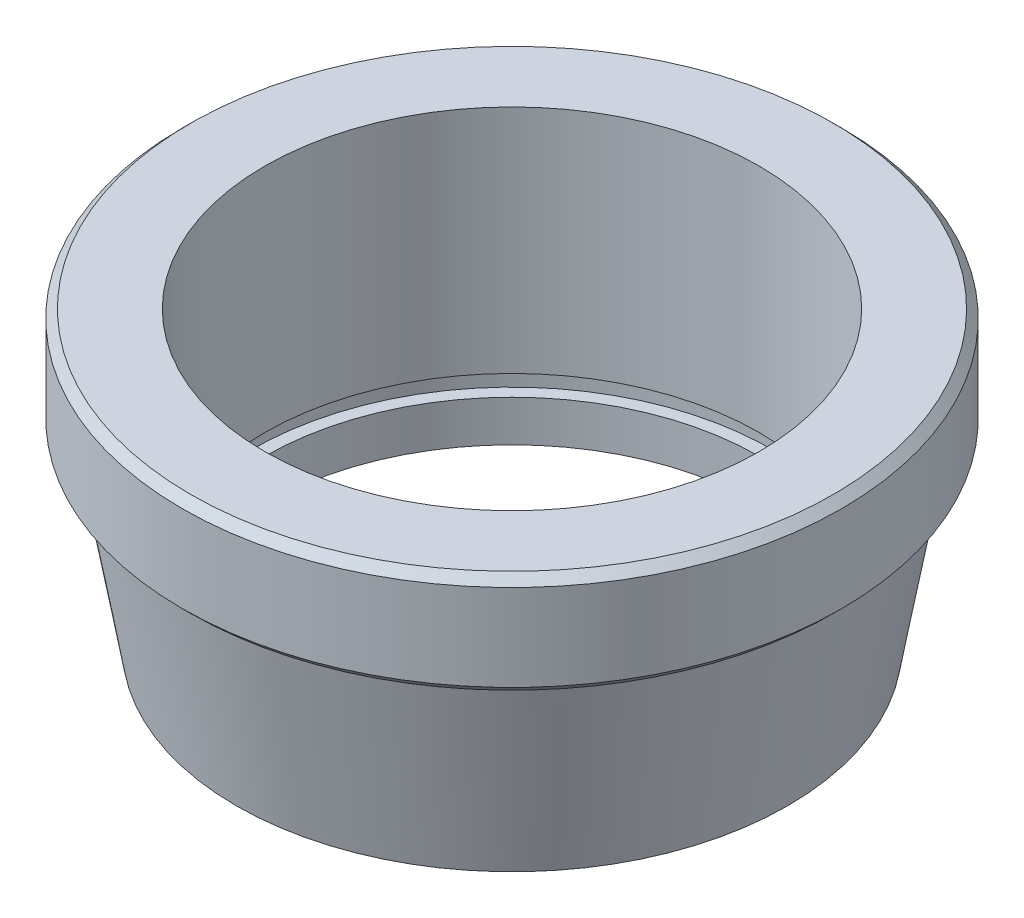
ISO-10303-21;
HEADER;
FILE_DESCRIPTION(('STEP AP214'),'2;1');
FILE_NAME('part.step','',(''),(''),'','','');
FILE_SCHEMA(('AUTOMOTIVE_DESIGN { 1 0 10303 214 1 1 1 1 }'));
ENDSEC;
DATA;
#1=APPLICATION_CONTEXT('core data for automotive mechanical design processes');
#2=APPLICATION_PROTOCOL_DEFINITION('international standard','automotive_design',2000,#1);
#3=PRODUCT_CONTEXT('',#1,'mechanical');
#4=PRODUCT('Part','Part','',(#3));
#5=PRODUCT_RELATED_PRODUCT_CATEGORY('part','',(#4));
#6=PRODUCT_DEFINITION_FORMATION('','',#4);
#7=PRODUCT_DEFINITION_CONTEXT('part definition',#1,'design');
#8=PRODUCT_DEFINITION('design','',#6,#7);
#9=PRODUCT_DEFINITION_SHAPE('','',#8);
#10=(LENGTH_UNIT() NAMED_UNIT(*) SI_UNIT(.MILLI.,.METRE.));
#11=(NAMED_UNIT(*) PLANE_ANGLE_UNIT() SI_UNIT($,.RADIAN.));
#12=(NAMED_UNIT(*) SI_UNIT($,.STERADIAN.) SOLID_ANGLE_UNIT());
#13=UNCERTAINTY_MEASURE_WITH_UNIT(LENGTH_MEASURE(1.E-05),#10,'distance_accuracy_value','');
#14=(GEOMETRIC_REPRESENTATION_CONTEXT(3) GLOBAL_UNCERTAINTY_ASSIGNED_CONTEXT((#13)) GLOBAL_UNIT_ASSIGNED_CONTEXT((#10,
#11,#12)) REPRESENTATION_CONTEXT('',''));
#15=CARTESIAN_POINT('',(0.,0.,0.));
#16=DIRECTION('',(0.,0.,1.));
#17=DIRECTION('',(1.,0.,0.));
#18=AXIS2_PLACEMENT_3D('',#15,#16,#17);
#19=CARTESIAN_POINT('',(0.,0.,0.));
#20=DIRECTION('',(0.,1.,0.));
#21=DIRECTION('',(0.,0.,1.));
#22=AXIS2_PLACEMENT_3D('',#19,#20,#21);
#23=CYLINDRICAL_SURFACE('',#22,6.);
#24=CARTESIAN_POINT('',(0.,-3.1,0.));
#25=DIRECTION('',(0.,1.,0.));
#26=DIRECTION('',(0.,0.,1.));
#27=AXIS2_PLACEMENT_3D('',#24,#25,#26);
#28=CIRCLE('',#27,6.);
#29=CARTESIAN_POINT('',(0.,-3.1,6.));
#30=VERTEX_POINT('',#29);
#31=EDGE_CURVE('E66',#30,#30,#28,.T.);
#32=ORIENTED_EDGE('',*,*,#31,.F.);
#33=EDGE_LOOP('',(#32));
#34=FACE_BOUND('',#33,.T.);
#35=CARTESIAN_POINT('',(0.,2.5,0.));
#36=DIRECTION('',(0.,1.,0.));
#37=DIRECTION('',(0.,0.,1.));
#38=AXIS2_PLACEMENT_3D('',#35,#36,#37);
#39=CIRCLE('',#38,6.);
#40=CARTESIAN_POINT('',(0.,2.5,6.));
#41=VERTEX_POINT('',#40);
#42=EDGE_CURVE('E57',#41,#41,#39,.T.);
#43=ORIENTED_EDGE('',*,*,#42,.T.);
#44=EDGE_LOOP('',(#43));
#45=FACE_BOUND('',#44,.T.);
#46=ADVANCED_FACE('F31',(#34,#45),#23,.F.);
#47=CARTESIAN_POINT('',(0.,0.,0.));
#48=DIRECTION('',(0.,1.,0.));
#49=DIRECTION('',(0.,0.,1.));
#50=AXIS2_PLACEMENT_3D('',#47,#48,#49);
#51=CONICAL_SURFACE('',#50,7.5,0.174532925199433);
#52=CARTESIAN_POINT('',(0.,-4.6,0.));
#53=DIRECTION('',(0.,1.,0.));
#54=DIRECTION('',(0.,0.,1.));
#55=AXIS2_PLACEMENT_3D('',#52,#53,#54);
#56=CIRCLE('',#55,6.68889588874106);
#57=CARTESIAN_POINT('',(0.,-4.6,6.68889588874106));
#58=VERTEX_POINT('',#57);
#59=EDGE_CURVE('E51',#58,#58,#56,.T.);
#60=ORIENTED_EDGE('',*,*,#59,.T.);
#61=EDGE_LOOP('',(#60));
#62=FACE_BOUND('',#61,.T.);
#63=CARTESIAN_POINT('',(0.,0.,0.));
#64=DIRECTION('',(0.,1.,0.));
#65=DIRECTION('',(0.,0.,1.));
#66=AXIS2_PLACEMENT_3D('',#63,#64,#65);
#67=CIRCLE('',#66,7.5);
#68=CARTESIAN_POINT('',(0.,0.,7.5));
#69=VERTEX_POINT('',#68);
#70=EDGE_CURVE('E54',#69,#69,#67,.T.);
#71=ORIENTED_EDGE('',*,*,#70,.F.);
#72=EDGE_LOOP('',(#71));
#73=FACE_BOUND('',#72,.T.);
#74=ADVANCED_FACE('F93',(#62,#73),#51,.T.);
#75=CARTESIAN_POINT('',(0.,-4.6,0.));
#76=DIRECTION('',(0.,1.,0.));
#77=DIRECTION('',(0.,0.,1.));
#78=AXIS2_PLACEMENT_3D('',#75,#76,#77);
#79=PLANE('',#78);
#80=CARTESIAN_POINT('',(0.,-4.6,0.));
#81=DIRECTION('',(0.,-1.,0.));
#82=DIRECTION('',(0.,0.,-1.));
#83=AXIS2_PLACEMENT_3D('',#80,#81,#82);
#84=CIRCLE('',#83,6.);
#85=CARTESIAN_POINT('',(0.,-4.6,-6.));
#86=VERTEX_POINT('',#85);
#87=EDGE_CURVE('E60',#86,#86,#84,.T.);
#88=ORIENTED_EDGE('',*,*,#87,.F.);
#89=EDGE_LOOP('',(#88));
#90=FACE_BOUND('',#89,.T.);
#91=ORIENTED_EDGE('',*,*,#59,.F.);
#92=EDGE_LOOP('',(#91));
#93=FACE_BOUND('',#92,.T.);
#94=ADVANCED_FACE('F108',(#90,#93),#79,.F.);
#95=CARTESIAN_POINT('',(0.,2.5,0.));
#96=DIRECTION('',(0.,-1.,0.));
#97=DIRECTION('',(0.,0.,-1.));
#98=AXIS2_PLACEMENT_3D('',#95,#96,#97);
#99=CYLINDRICAL_SURFACE('',#98,8.);
#100=CARTESIAN_POINT('',(0.,0.199999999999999,0.));
#101=DIRECTION('',(0.,1.,0.));
#102=DIRECTION('',(0.,0.,1.));
#103=AXIS2_PLACEMENT_3D('',#100,#101,#102);
#104=CIRCLE('',#103,8.);
#105=CARTESIAN_POINT('',(0.,0.199999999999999,8.));
#106=VERTEX_POINT('',#105);
#107=EDGE_CURVE('E42',#106,#106,#104,.T.);
#108=ORIENTED_EDGE('',*,*,#107,.T.);
#109=EDGE_LOOP('',(#108));
#110=FACE_BOUND('',#109,.T.);
#111=CARTESIAN_POINT('',(0.,2.3,0.));
#112=DIRECTION('',(0.,1.,0.));
#113=DIRECTION('',(0.,0.,1.));
#114=AXIS2_PLACEMENT_3D('',#111,#112,#113);
#115=CIRCLE('',#114,8.);
#116=CARTESIAN_POINT('',(0.,2.3,8.));
#117=VERTEX_POINT('',#116);
#118=EDGE_CURVE('E46',#117,#117,#115,.F.);
#119=ORIENTED_EDGE('',*,*,#118,.T.);
#120=EDGE_LOOP('',(#119));
#121=FACE_BOUND('',#120,.T.);
#122=ADVANCED_FACE('F100',(#110,#121),#99,.T.);
#123=CARTESIAN_POINT('',(0.,2.5,0.));
#124=DIRECTION('',(0.,1.,0.));
#125=DIRECTION('',(0.,0.,1.));
#126=AXIS2_PLACEMENT_3D('',#123,#124,#125);
#127=PLANE('',#126);
#128=ORIENTED_EDGE('',*,*,#42,.F.);
#129=EDGE_LOOP('',(#128));
#130=FACE_BOUND('',#129,.T.);
#131=CARTESIAN_POINT('',(0.,2.5,0.));
#132=DIRECTION('',(0.,1.,0.));
#133=DIRECTION('',(0.,0.,1.));
#134=AXIS2_PLACEMENT_3D('',#131,#132,#133);
#135=CIRCLE('',#134,7.8);
#136=CARTESIAN_POINT('',(0.,2.5,7.8));
#137=VERTEX_POINT('',#136);
#138=EDGE_CURVE('E10',#137,#137,#135,.T.);
#139=ORIENTED_EDGE('',*,*,#138,.T.);
#140=EDGE_LOOP('',(#139));
#141=FACE_BOUND('',#140,.T.);
#142=ADVANCED_FACE('F97',(#130,#141),#127,.T.);
#143=CARTESIAN_POINT('',(0.,0.,0.));
#144=DIRECTION('',(0.,1.,0.));
#145=DIRECTION('',(0.,0.,1.));
#146=AXIS2_PLACEMENT_3D('',#143,#144,#145);
#147=PLANE('',#146);
#148=CARTESIAN_POINT('',(0.,0.,0.));
#149=DIRECTION('',(0.,1.,0.));
#150=DIRECTION('',(0.,0.,1.));
#151=AXIS2_PLACEMENT_3D('',#148,#149,#150);
#152=CIRCLE('',#151,7.8);
#153=CARTESIAN_POINT('',(0.,0.,7.8));
#154=VERTEX_POINT('',#153);
#155=EDGE_CURVE('E38',#154,#154,#152,.F.);
#156=ORIENTED_EDGE('',*,*,#155,.T.);
#157=EDGE_LOOP('',(#156));
#158=FACE_BOUND('',#157,.T.);
#159=ORIENTED_EDGE('',*,*,#70,.T.);
#160=EDGE_LOOP('',(#159));
#161=FACE_BOUND('',#160,.T.);
#162=ADVANCED_FACE('F99',(#158,#161),#147,.F.);
#163=CARTESIAN_POINT('',(0.,0.199999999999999,0.));
#164=DIRECTION('',(0.,1.,0.));
#165=DIRECTION('',(0.,0.,1.));
#166=AXIS2_PLACEMENT_3D('',#163,#164,#165);
#167=CONICAL_SURFACE('',#166,8.,0.785398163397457);
#168=ORIENTED_EDGE('',*,*,#155,.F.);
#169=EDGE_LOOP('',(#168));
#170=FACE_BOUND('',#169,.T.);
#171=ORIENTED_EDGE('',*,*,#107,.F.);
#172=EDGE_LOOP('',(#171));
#173=FACE_BOUND('',#172,.T.);
#174=ADVANCED_FACE('F106',(#170,#173),#167,.T.);
#175=CARTESIAN_POINT('',(0.,2.5,0.));
#176=DIRECTION('',(0.,-1.,0.));
#177=DIRECTION('',(0.,0.,-1.));
#178=AXIS2_PLACEMENT_3D('',#175,#176,#177);
#179=CONICAL_SURFACE('',#178,7.8,0.785398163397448);
#180=ORIENTED_EDGE('',*,*,#118,.F.);
#181=EDGE_LOOP('',(#180));
#182=FACE_BOUND('',#181,.T.);
#183=ORIENTED_EDGE('',*,*,#138,.F.);
#184=EDGE_LOOP('',(#183));
#185=FACE_BOUND('',#184,.T.);
#186=ADVANCED_FACE('F33',(#182,#185),#179,.T.);
#187=CARTESIAN_POINT('',(0.,-3.6,0.));
#188=DIRECTION('',(0.,1.,0.));
#189=DIRECTION('',(0.,0.,1.));
#190=AXIS2_PLACEMENT_3D('',#187,#188,#189);
#191=CIRCLE('',#190,6.);
#192=CARTESIAN_POINT('',(0.,-3.6,6.));
#193=VERTEX_POINT('',#192);
#194=EDGE_CURVE('E69',#193,#193,#191,.T.);
#195=ORIENTED_EDGE('',*,*,#194,.T.);
#196=EDGE_LOOP('',(#195));
#197=FACE_BOUND('',#196,.T.);
#198=ORIENTED_EDGE('',*,*,#87,.T.);
#199=EDGE_LOOP('',(#198));
#200=FACE_BOUND('',#199,.T.);
#201=ADVANCED_FACE('F82',(#197,#200),#23,.F.);
#202=CARTESIAN_POINT('',(0.,2.5,0.));
#203=DIRECTION('',(0.,1.,0.));
#204=DIRECTION('',(0.,0.,1.));
#205=AXIS2_PLACEMENT_3D('',#202,#203,#204);
#206=CYLINDRICAL_SURFACE('',#205,6.3);
#207=CARTESIAN_POINT('',(0.,-3.6,0.));
#208=DIRECTION('',(0.,1.,0.));
#209=DIRECTION('',(0.,0.,1.));
#210=AXIS2_PLACEMENT_3D('',#207,#208,#209);
#211=CIRCLE('',#210,6.3);
#212=CARTESIAN_POINT('',(0.,-3.6,6.3));
#213=VERTEX_POINT('',#212);
#214=EDGE_CURVE('E72',#213,#213,#211,.T.);
#215=ORIENTED_EDGE('',*,*,#214,.F.);
#216=EDGE_LOOP('',(#215));
#217=FACE_BOUND('',#216,.T.);
#218=CARTESIAN_POINT('',(0.,-3.1,0.));
#219=DIRECTION('',(0.,1.,0.));
#220=DIRECTION('',(0.,0.,1.));
#221=AXIS2_PLACEMENT_3D('',#218,#219,#220);
#222=CIRCLE('',#221,6.3);
#223=CARTESIAN_POINT('',(0.,-3.1,6.3));
#224=VERTEX_POINT('',#223);
#225=EDGE_CURVE('E63',#224,#224,#222,.T.);
#226=ORIENTED_EDGE('',*,*,#225,.T.);
#227=EDGE_LOOP('',(#226));
#228=FACE_BOUND('',#227,.T.);
#229=ADVANCED_FACE('F78',(#217,#228),#206,.F.);
#230=CARTESIAN_POINT('',(-6.3,-3.1,0.));
#231=DIRECTION('',(0.,1.,0.));
#232=DIRECTION('',(0.,0.,1.));
#233=AXIS2_PLACEMENT_3D('',#230,#231,#232);
#234=PLANE('',#233);
#235=ORIENTED_EDGE('',*,*,#225,.F.);
#236=EDGE_LOOP('',(#235));
#237=FACE_BOUND('',#236,.T.);
#238=ORIENTED_EDGE('',*,*,#31,.T.);
#239=EDGE_LOOP('',(#238));
#240=FACE_BOUND('',#239,.T.);
#241=ADVANCED_FACE('F81',(#237,#240),#234,.F.);
#242=CARTESIAN_POINT('',(-6.3,-3.6,0.));
#243=DIRECTION('',(0.,-1.,0.));
#244=DIRECTION('',(0.,0.,-1.));
#245=AXIS2_PLACEMENT_3D('',#242,#243,#244);
#246=PLANE('',#245);
#247=ORIENTED_EDGE('',*,*,#194,.F.);
#248=EDGE_LOOP('',(#247));
#249=FACE_BOUND('',#248,.T.);
#250=ORIENTED_EDGE('',*,*,#214,.T.);
#251=EDGE_LOOP('',(#250));
#252=FACE_BOUND('',#251,.T.);
#253=ADVANCED_FACE('F76',(#249,#252),#246,.F.);
#254=CLOSED_SHELL('',(#46,#74,#94,#122,#142,#162,#174,#186,#201,#229,#241,#253));
#255=MANIFOLD_SOLID_BREP('B2',#254);
#256=ADVANCED_BREP_SHAPE_REPRESENTATION('',(#18,#255),#14);
#257=SHAPE_DEFINITION_REPRESENTATION(#9,#256);
ENDSEC;
END-ISO-10303-21;
